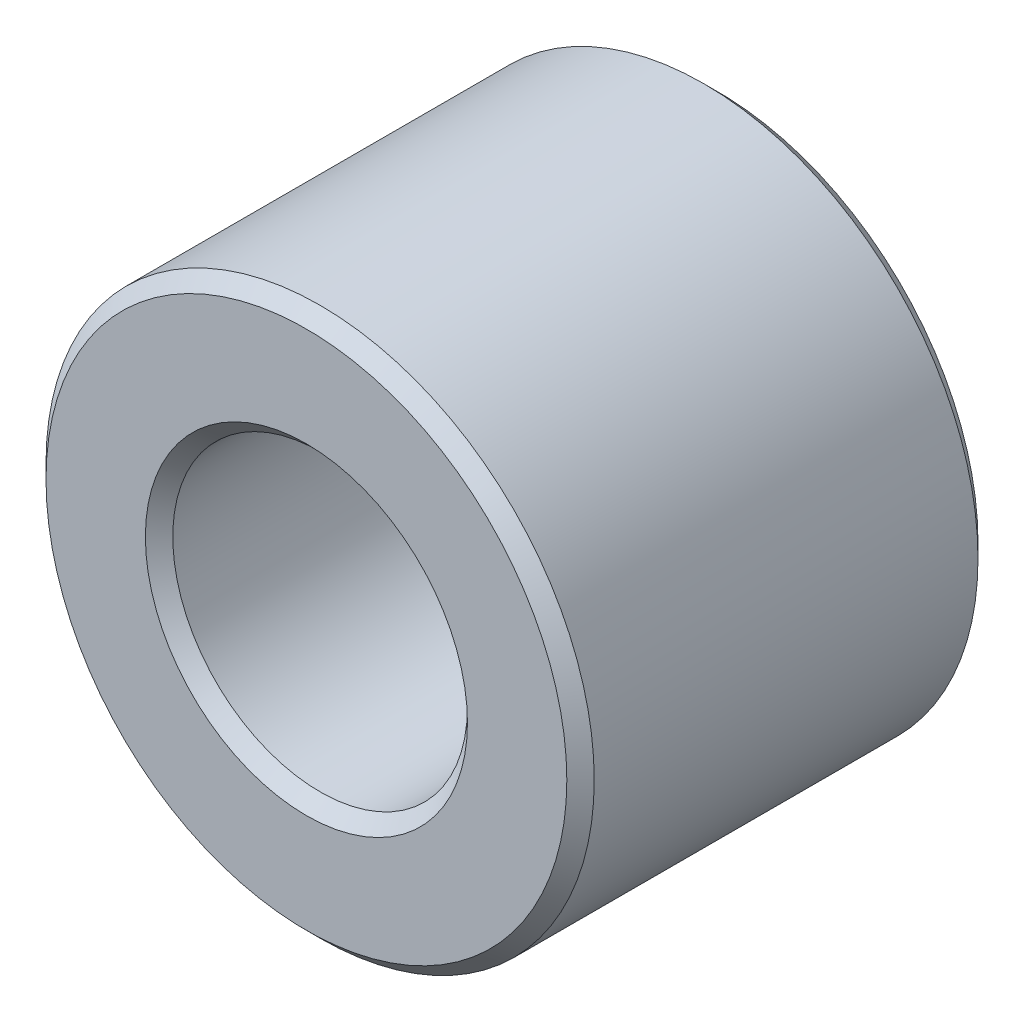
ISO-10303-21;
HEADER;
FILE_DESCRIPTION(('STEP AP214'),'2;1');
FILE_NAME('part.step','',(''),(''),'','','');
FILE_SCHEMA(('AUTOMOTIVE_DESIGN { 1 0 10303 214 1 1 1 1 }'));
ENDSEC;
DATA;
#1=APPLICATION_CONTEXT('core data for automotive mechanical design processes');
#2=APPLICATION_PROTOCOL_DEFINITION('international standard','automotive_design',2000,#1);
#3=PRODUCT_CONTEXT('',#1,'mechanical');
#4=PRODUCT('Part','Part','',(#3));
#5=PRODUCT_RELATED_PRODUCT_CATEGORY('part','',(#4));
#6=PRODUCT_DEFINITION_FORMATION('','',#4);
#7=PRODUCT_DEFINITION_CONTEXT('part definition',#1,'design');
#8=PRODUCT_DEFINITION('design','',#6,#7);
#9=PRODUCT_DEFINITION_SHAPE('','',#8);
#10=(LENGTH_UNIT() NAMED_UNIT(*) SI_UNIT(.MILLI.,.METRE.));
#11=(NAMED_UNIT(*) PLANE_ANGLE_UNIT() SI_UNIT($,.RADIAN.));
#12=(NAMED_UNIT(*) SI_UNIT($,.STERADIAN.) SOLID_ANGLE_UNIT());
#13=UNCERTAINTY_MEASURE_WITH_UNIT(LENGTH_MEASURE(1.E-05),#10,'distance_accuracy_value','');
#14=(GEOMETRIC_REPRESENTATION_CONTEXT(3) GLOBAL_UNCERTAINTY_ASSIGNED_CONTEXT((#13)) GLOBAL_UNIT_ASSIGNED_CONTEXT((#10,
#11,#12)) REPRESENTATION_CONTEXT('',''));
#15=CARTESIAN_POINT('',(0.,0.,0.));
#16=DIRECTION('',(0.,0.,1.));
#17=DIRECTION('',(1.,0.,0.));
#18=AXIS2_PLACEMENT_3D('',#15,#16,#17);
#19=CARTESIAN_POINT('',(0.,0.,3.));
#20=DIRECTION('',(0.,0.,1.));
#21=DIRECTION('',(1.,0.,0.));
#22=AXIS2_PLACEMENT_3D('',#19,#20,#21);
#23=PLANE('',#22);
#24=CARTESIAN_POINT('',(0.,0.,3.));
#25=DIRECTION('',(0.,0.,1.));
#26=DIRECTION('',(1.,0.,0.));
#27=AXIS2_PLACEMENT_3D('',#24,#25,#26);
#28=CIRCLE('',#27,2.35);
#29=CARTESIAN_POINT('',(2.35,0.,3.));
#30=VERTEX_POINT('',#29);
#31=EDGE_CURVE('E10',#30,#30,#28,.F.);
#32=ORIENTED_EDGE('',*,*,#31,.T.);
#33=EDGE_LOOP('',(#32));
#34=FACE_BOUND('',#33,.T.);
#35=CARTESIAN_POINT('',(0.,0.,3.));
#36=DIRECTION('',(0.,0.,1.));
#37=DIRECTION('',(1.,0.,0.));
#38=AXIS2_PLACEMENT_3D('',#35,#36,#37);
#39=CIRCLE('',#38,3.80000000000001);
#40=CARTESIAN_POINT('',(3.80000000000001,0.,3.));
#41=VERTEX_POINT('',#40);
#42=EDGE_CURVE('E45',#41,#41,#39,.T.);
#43=ORIENTED_EDGE('',*,*,#42,.T.);
#44=EDGE_LOOP('',(#43));
#45=FACE_BOUND('',#44,.T.);
#46=ADVANCED_FACE('F37',(#34,#45),#23,.T.);
#47=CARTESIAN_POINT('',(0.,0.,-3.));
#48=DIRECTION('',(0.,0.,1.));
#49=DIRECTION('',(1.,0.,0.));
#50=AXIS2_PLACEMENT_3D('',#47,#48,#49);
#51=PLANE('',#50);
#52=CARTESIAN_POINT('',(0.,0.,-3.));
#53=DIRECTION('',(0.,0.,1.));
#54=DIRECTION('',(1.,0.,0.));
#55=AXIS2_PLACEMENT_3D('',#52,#53,#54);
#56=CIRCLE('',#55,3.8);
#57=CARTESIAN_POINT('',(3.8,0.,-3.));
#58=VERTEX_POINT('',#57);
#59=EDGE_CURVE('E62',#58,#58,#56,.F.);
#60=ORIENTED_EDGE('',*,*,#59,.T.);
#61=EDGE_LOOP('',(#60));
#62=FACE_BOUND('',#61,.T.);
#63=CARTESIAN_POINT('',(0.,0.,-3.));
#64=DIRECTION('',(0.,0.,1.));
#65=DIRECTION('',(1.,0.,0.));
#66=AXIS2_PLACEMENT_3D('',#63,#64,#65);
#67=CIRCLE('',#66,2.35);
#68=CARTESIAN_POINT('',(2.35,0.,-3.));
#69=VERTEX_POINT('',#68);
#70=EDGE_CURVE('E65',#69,#69,#67,.T.);
#71=ORIENTED_EDGE('',*,*,#70,.T.);
#72=EDGE_LOOP('',(#71));
#73=FACE_BOUND('',#72,.T.);
#74=ADVANCED_FACE('F89',(#62,#73),#51,.F.);
#75=CARTESIAN_POINT('',(0.,0.,3.));
#76=DIRECTION('',(0.,0.,-1.));
#77=DIRECTION('',(-1.,0.,0.));
#78=AXIS2_PLACEMENT_3D('',#75,#76,#77);
#79=CYLINDRICAL_SURFACE('',#78,4.);
#80=CARTESIAN_POINT('',(0.,0.,-2.8));
#81=DIRECTION('',(0.,0.,1.));
#82=DIRECTION('',(1.,0.,0.));
#83=AXIS2_PLACEMENT_3D('',#80,#81,#82);
#84=CIRCLE('',#83,4.);
#85=CARTESIAN_POINT('',(4.,0.,-2.8));
#86=VERTEX_POINT('',#85);
#87=EDGE_CURVE('E69',#86,#86,#84,.T.);
#88=ORIENTED_EDGE('',*,*,#87,.T.);
#89=EDGE_LOOP('',(#88));
#90=FACE_BOUND('',#89,.T.);
#91=CARTESIAN_POINT('',(0.,0.,2.8));
#92=DIRECTION('',(0.,0.,1.));
#93=DIRECTION('',(1.,0.,0.));
#94=AXIS2_PLACEMENT_3D('',#91,#92,#93);
#95=CIRCLE('',#94,4.);
#96=CARTESIAN_POINT('',(4.,0.,2.8));
#97=VERTEX_POINT('',#96);
#98=EDGE_CURVE('E73',#97,#97,#95,.F.);
#99=ORIENTED_EDGE('',*,*,#98,.T.);
#100=EDGE_LOOP('',(#99));
#101=FACE_BOUND('',#100,.T.);
#102=ADVANCED_FACE('F78',(#90,#101),#79,.T.);
#103=CARTESIAN_POINT('',(0.,0.,3.));
#104=DIRECTION('',(0.,0.,-1.));
#105=DIRECTION('',(-1.,0.,0.));
#106=AXIS2_PLACEMENT_3D('',#103,#104,#105);
#107=CYLINDRICAL_SURFACE('',#106,2.15);
#108=CARTESIAN_POINT('',(0.,0.,-2.8));
#109=DIRECTION('',(0.,0.,1.));
#110=DIRECTION('',(1.,0.,0.));
#111=AXIS2_PLACEMENT_3D('',#108,#109,#110);
#112=CIRCLE('',#111,2.15);
#113=CARTESIAN_POINT('',(2.15,0.,-2.8));
#114=VERTEX_POINT('',#113);
#115=EDGE_CURVE('E51',#114,#114,#112,.F.);
#116=ORIENTED_EDGE('',*,*,#115,.T.);
#117=EDGE_LOOP('',(#116));
#118=FACE_BOUND('',#117,.T.);
#119=CARTESIAN_POINT('',(0.,0.,2.8));
#120=DIRECTION('',(0.,0.,1.));
#121=DIRECTION('',(1.,0.,0.));
#122=AXIS2_PLACEMENT_3D('',#119,#120,#121);
#123=CIRCLE('',#122,2.15);
#124=CARTESIAN_POINT('',(2.15,0.,2.8));
#125=VERTEX_POINT('',#124);
#126=EDGE_CURVE('E57',#125,#125,#123,.T.);
#127=ORIENTED_EDGE('',*,*,#126,.T.);
#128=EDGE_LOOP('',(#127));
#129=FACE_BOUND('',#128,.T.);
#130=ADVANCED_FACE('F97',(#118,#129),#107,.F.);
#131=CARTESIAN_POINT('',(0.,0.,-2.8));
#132=DIRECTION('',(0.,0.,1.));
#133=DIRECTION('',(1.,0.,0.));
#134=AXIS2_PLACEMENT_3D('',#131,#132,#133);
#135=CONICAL_SURFACE('',#134,4.,0.78539816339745);
#136=ORIENTED_EDGE('',*,*,#59,.F.);
#137=EDGE_LOOP('',(#136));
#138=FACE_BOUND('',#137,.T.);
#139=ORIENTED_EDGE('',*,*,#87,.F.);
#140=EDGE_LOOP('',(#139));
#141=FACE_BOUND('',#140,.T.);
#142=ADVANCED_FACE('F102',(#138,#141),#135,.T.);
#143=CARTESIAN_POINT('',(0.,0.,-3.));
#144=DIRECTION('',(0.,0.,-1.));
#145=DIRECTION('',(-1.,0.,0.));
#146=AXIS2_PLACEMENT_3D('',#143,#144,#145);
#147=CONICAL_SURFACE('',#146,2.35,0.785398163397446);
#148=ORIENTED_EDGE('',*,*,#115,.F.);
#149=EDGE_LOOP('',(#148));
#150=FACE_BOUND('',#149,.T.);
#151=ORIENTED_EDGE('',*,*,#70,.F.);
#152=EDGE_LOOP('',(#151));
#153=FACE_BOUND('',#152,.T.);
#154=ADVANCED_FACE('F86',(#150,#153),#147,.F.);
#155=CARTESIAN_POINT('',(0.,0.,2.8));
#156=DIRECTION('',(0.,0.,1.));
#157=DIRECTION('',(1.,0.,0.));
#158=AXIS2_PLACEMENT_3D('',#155,#156,#157);
#159=CONICAL_SURFACE('',#158,2.15,0.785398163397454);
#160=ORIENTED_EDGE('',*,*,#31,.F.);
#161=EDGE_LOOP('',(#160));
#162=FACE_BOUND('',#161,.T.);
#163=ORIENTED_EDGE('',*,*,#126,.F.);
#164=EDGE_LOOP('',(#163));
#165=FACE_BOUND('',#164,.T.);
#166=ADVANCED_FACE('F82',(#162,#165),#159,.F.);
#167=CARTESIAN_POINT('',(0.,0.,3.));
#168=DIRECTION('',(0.,0.,-1.));
#169=DIRECTION('',(-1.,0.,0.));
#170=AXIS2_PLACEMENT_3D('',#167,#168,#169);
#171=CONICAL_SURFACE('',#170,3.80000000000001,0.785398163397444);
#172=ORIENTED_EDGE('',*,*,#98,.F.);
#173=EDGE_LOOP('',(#172));
#174=FACE_BOUND('',#173,.T.);
#175=ORIENTED_EDGE('',*,*,#42,.F.);
#176=EDGE_LOOP('',(#175));
#177=FACE_BOUND('',#176,.T.);
#178=ADVANCED_FACE('F39',(#174,#177),#171,.T.);
#179=CLOSED_SHELL('',(#46,#74,#102,#130,#142,#154,#166,#178));
#180=MANIFOLD_SOLID_BREP('B2',#179);
#181=ADVANCED_BREP_SHAPE_REPRESENTATION('',(#18,#180),#14);
#182=SHAPE_DEFINITION_REPRESENTATION(#9,#181);
ENDSEC;
END-ISO-10303-21;
